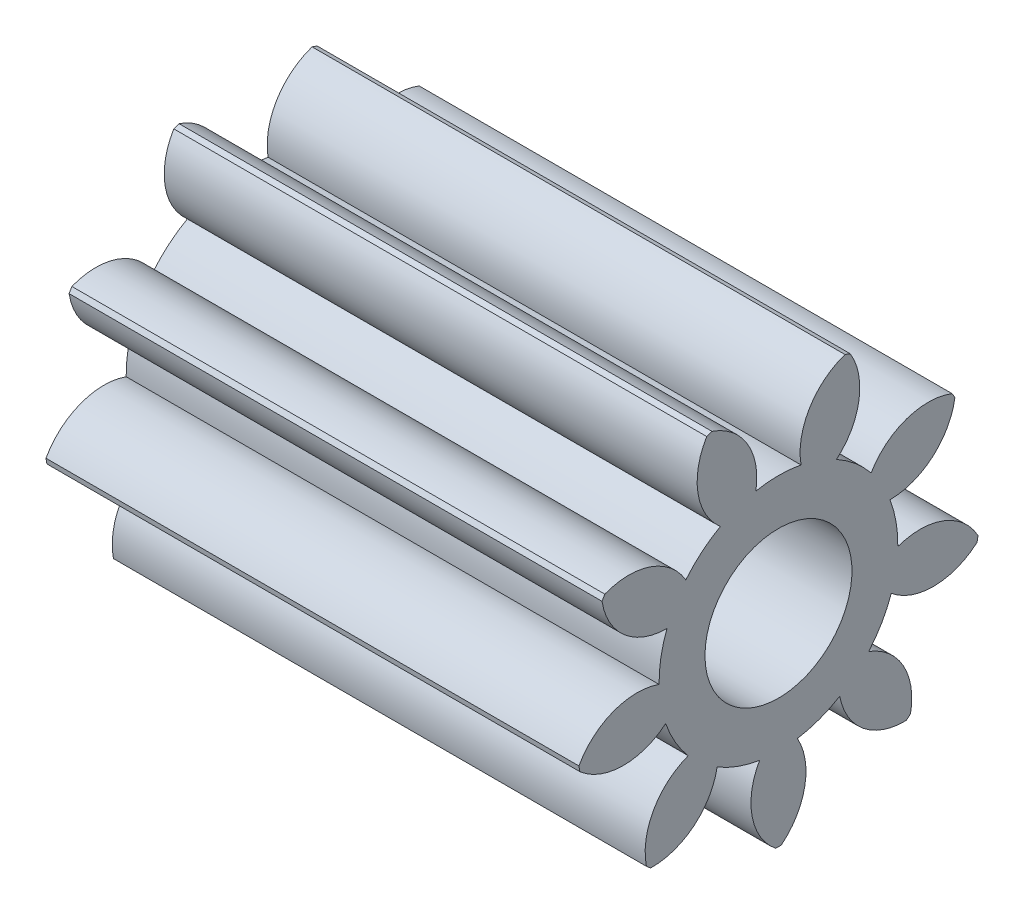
from build123d import *

# Parameters (mm, degrees)
BASPROSKE_W     = 7.25
BASPROSKE_H     = 2.75
TOOTHCUT_DEPTH  = 9.227241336
TEETHCUTS_COUNT = 9
BORSKE_R        = 1
BORE_DEPTH      = 50.0000508


with BuildPart() as part:
    # BasProSke → Base-Revolve (revolve)
    with BuildSketch(Plane(origin=(0, 0, 0), x_dir=(1, 0, 0), z_dir=(0, 1, 0)), mode=Mode.PRIVATE) as base_revolve_sk:
        with Locations((3.625, 1.375)):
            Rectangle(BASPROSKE_W, BASPROSKE_H)
    revolve(base_revolve_sk.sketch.rotate(Axis((-10, 0, 0), (1, 0, 0)), 180), axis=Axis((-10, 0, 0), (1, 0, 0)))

    # TooCutSke → ToothCut (cut, through all)
    with BuildSketch(Plane(origin=(0, 0, 0), x_dir=(0, 0, -1), z_dir=(1, 0, 0))):
        with BuildLine():
            ThreePointArc((0.306960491, 1.594726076), (0, 1.624), (-0.306960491, 1.594726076))
            ThreePointArc((-0.306960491, 1.594726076), (-0.432575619, 2.223839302), (-0.945269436, 2.609465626))
            ThreePointArc((-0.945269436, 2.609465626), (0, 2.7754), (0.945269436, 2.609465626))
            ThreePointArc((0.945269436, 2.609465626), (0.432575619, 2.223839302), (0.306960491, 1.594726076))
        make_face()
    toothcut = extrude(amount=TOOTHCUT_DEPTH, mode=Mode.SUBTRACT)

    # TeethCuts: ToothCut ×9 about axis
    teethcuts_axis = Axis((0, 0, 0), (1, 0, 0))
    for i in range(1, TEETHCUTS_COUNT):
        add(toothcut.rotate(teethcuts_axis, i * 360 / TEETHCUTS_COUNT), mode=Mode.SUBTRACT)

    # BorSke → Bore (cut, symmetric)
    with BuildSketch(Plane(origin=(0, 0, 0), x_dir=(0, 0, -1), z_dir=(1, 0, 0))):
        with Locations(Location((0, 0, 0), (0, 0, 180))):
            Circle(BORSKE_R)
    extrude(amount=BORE_DEPTH, both=True, mode=Mode.SUBTRACT)


solid = part.part
